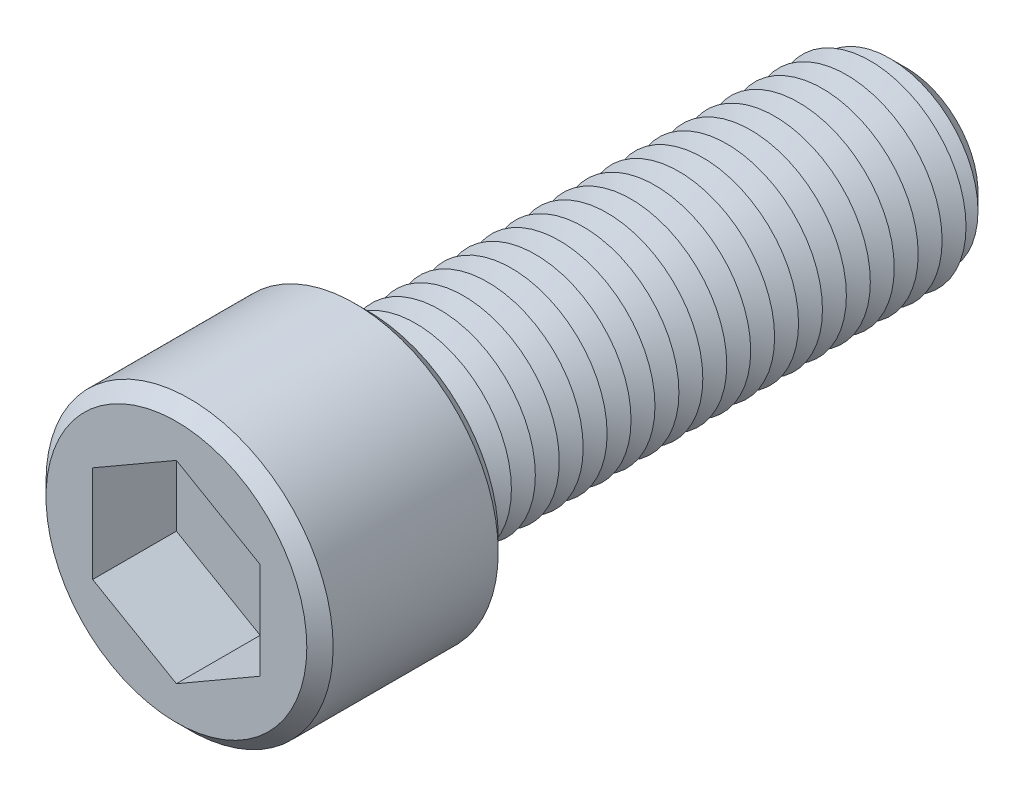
from build123d import *

# Parameters (mm, degrees)
SKETCH1_R           = 12
BOSS_EXTRUDE1_DEPTH = 16
SKETCH2_R           = 8
BOSS_EXTRUDE2_DEPTH = 45
CHAMFER1_SIZE       = 2
LPATTERN1_COUNT     = 22
LPATTERN1_PITCH     = 2
CUT_EXTRUDE1_DEPTH  = 7
SKETCH6_R           = 0.9
CUT_EXTRUDE2_DEPTH  = 54
CHAMFER2_SIZE       = 1.1


with BuildPart() as part:
    # Sketch1 → Boss-Extrude1 (new body)
    with BuildSketch(Plane.XY):
        Circle(SKETCH1_R)
    extrude(amount=BOSS_EXTRUDE1_DEPTH)

    # Sketch2 → Boss-Extrude2 (add)
    with BuildSketch(Plane(origin=(0, 0, 0), x_dir=(-1, 0, 0), z_dir=(0, 0, -1))):
        with Locations(Location((0, 0, 0), (0, 0, 180))):
            Circle(SKETCH2_R)
    extrude(amount=BOSS_EXTRUDE2_DEPTH)

    # Chamfer1
    chamfer1_edges = [part.edges().sort_by_distance(p)[0] for p in [
        (-8, 0, -45),
    ]]
    chamfer(chamfer1_edges, length=CHAMFER1_SIZE)

    # Sketch4 → Cut-Revolve1 (revolve, cut)
    with BuildSketch(Plane(origin=(0, 0, 0), x_dir=(0, 0, -1), z_dir=(1, 0, 0)), mode=Mode.PRIVATE) as cut_revolve1_sk:
        Polygon((0, 8), (1, 6.267949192), (2, 8), align=None)
    cut_revolve1 = revolve(cut_revolve1_sk.sketch.rotate(Axis((0, 0, 2.512122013), (0, 0, -1)), 90), axis=Axis((0, 0, 2.512122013), (0, 0, -1)), mode=Mode.SUBTRACT)

    # LPattern1: Cut-Revolve1 ×22
    with Locations(*[(0, 0, -i * LPATTERN1_PITCH) for i in range(1, LPATTERN1_COUNT)]):
        add(cut_revolve1, mode=Mode.SUBTRACT)

    # Sketch5 → Cut-Extrude1 (cut)
    with BuildSketch(Plane.XY.offset(16)):
        Polygon((0, 8.082903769), (-7, 4.041451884), (-7, -4.041451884), (0, -8.082903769), (7, -4.041451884), (7, 4.041451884), align=None)
    extrude(amount=-CUT_EXTRUDE1_DEPTH, mode=Mode.SUBTRACT)

    # Sketch6 → Cut-Extrude2 (cut)
    with BuildSketch(Plane.XY.offset(9)):
        Circle(SKETCH6_R)
    extrude(amount=-CUT_EXTRUDE2_DEPTH, mode=Mode.SUBTRACT)

    # Chamfer2
    chamfer2_edges = [part.edges().sort_by_distance(p)[0] for p in [
        (-12, 0, 0),
        (-12, 0, 16),
    ]]
    chamfer(chamfer2_edges, length=CHAMFER2_SIZE)


solid = part.part
